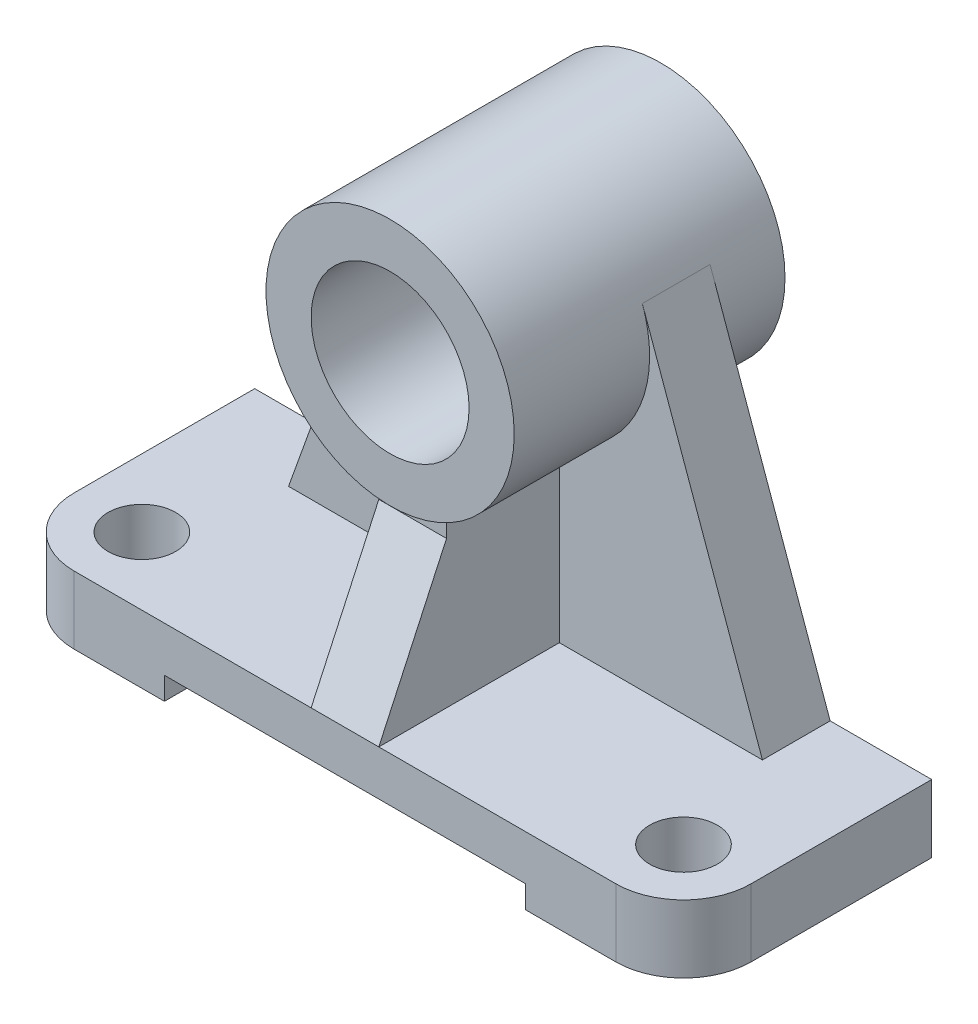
from build123d import *

# Parameters (mm, degrees)
SKETCH_1_R          = 3
EXTRUDE_1_DEPTH     = 6
SKETCH_2_W          = 32
SKETCH_2_H          = 2
CUT_EXTRUDE_1_DEPTH = 38.682887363
SKETCH_3_R          = 11
SKETCH_3_R_2        = 7
EXTRUDE_2_DEPTH     = 24
EXTRUDE_3_DEPTH     = 6
EXTRUDE_4_DEPTH     = 3


with BuildPart() as part:
    # Sketch 1 → Extrude 1 (new body)
    with BuildSketch(Plane(origin=(0, 0, 0), x_dir=(1, 0, 0), z_dir=(0, 1, 0))):
        with BuildLine():
            Line((30, 0), (-30, 0))
            Line((-30, 0), (-30, -16))
            ThreePointArc((-30, -16), (-28.242640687, -20.242640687), (-24, -22))
            Line((-24, -22), (24, -22))
            ThreePointArc((24, -22), (28.242640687, -20.242640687), (30, -16))
            Line((30, -16), (30, 0))
        make_face()
        with Locations(Location((-24, -16, 0), (0, 0, 270))):
            Circle(SKETCH_1_R, mode=Mode.SUBTRACT)
        with Locations(Location((24, -16, 0), (0, 0, 90))):
            Circle(SKETCH_1_R, mode=Mode.SUBTRACT)
    extrude(amount=EXTRUDE_1_DEPTH)

    # Sketch 2 → Cut-Extrude 1 (cut, through all)
    with BuildSketch(Plane.XY.offset(22)):
        with Locations((0, 1)):
            Rectangle(SKETCH_2_W, SKETCH_2_H)
    extrude(amount=-CUT_EXTRUDE_1_DEPTH, mode=Mode.SUBTRACT)



with BuildPart() as body_2:
    # Sketch 3 → Extrude 2 (new body)
    with BuildSketch(Plane.XY.offset(-6)):
        with Locations((0, 32)):
            Circle(SKETCH_3_R)
        with Locations((0, 32)):
            Circle(SKETCH_3_R_2, mode=Mode.SUBTRACT)
    extrude(amount=EXTRUDE_2_DEPTH)


with BuildPart() as part_1:
    add(part.part)

    add(body_2.part)  # Extrude 3 merges body 2
    # Sketch 4 → Extrude 3 (add)
    with BuildSketch(Plane.XY):
        with BuildLine():
            Line((-10.355423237, 35.710149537), (-21, 6))
            Line((-21, 6), (21, 6))
            Line((21, 6), (10.355423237, 35.710149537))
            ThreePointArc((10.355423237, 35.710149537), (0, 21), (-10.355423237, 35.710149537))
        make_face()
    extrude(amount=EXTRUDE_3_DEPTH)

    # Sketch 5 → Extrude 4 (add, symmetric)
    with BuildSketch(Plane(origin=(0, 0, 0), x_dir=(0, 0, -1), z_dir=(1, 0, 0))):
        Polygon((-16, 22.836959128), (-6, 22.836959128), (-6, 6), (-22, 6), (-16, 19), align=None)
    extrude(amount=EXTRUDE_4_DEPTH, both=True)


solid = part_1.part
